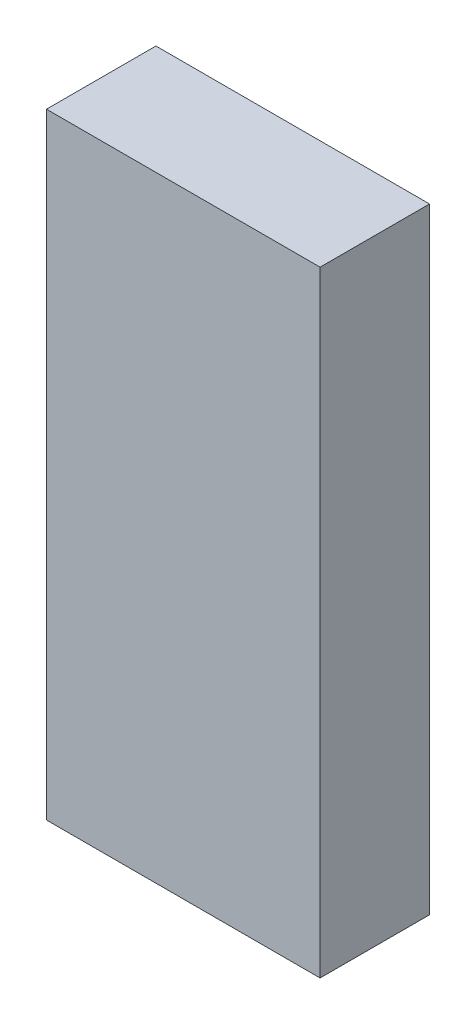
ISO-10303-21;
HEADER;
FILE_DESCRIPTION(('STEP AP214'),'2;1');
FILE_NAME('part.step','',(''),(''),'','','');
FILE_SCHEMA(('AUTOMOTIVE_DESIGN { 1 0 10303 214 1 1 1 1 }'));
ENDSEC;
DATA;
#1=APPLICATION_CONTEXT('core data for automotive mechanical design processes');
#2=APPLICATION_PROTOCOL_DEFINITION('international standard','automotive_design',2000,#1);
#3=PRODUCT_CONTEXT('',#1,'mechanical');
#4=PRODUCT('Part','Part','',(#3));
#5=PRODUCT_RELATED_PRODUCT_CATEGORY('part','',(#4));
#6=PRODUCT_DEFINITION_FORMATION('','',#4);
#7=PRODUCT_DEFINITION_CONTEXT('part definition',#1,'design');
#8=PRODUCT_DEFINITION('design','',#6,#7);
#9=PRODUCT_DEFINITION_SHAPE('','',#8);
#10=(LENGTH_UNIT() NAMED_UNIT(*) SI_UNIT(.MILLI.,.METRE.));
#11=(NAMED_UNIT(*) PLANE_ANGLE_UNIT() SI_UNIT($,.RADIAN.));
#12=(NAMED_UNIT(*) SI_UNIT($,.STERADIAN.) SOLID_ANGLE_UNIT());
#13=UNCERTAINTY_MEASURE_WITH_UNIT(LENGTH_MEASURE(1.E-05),#10,'distance_accuracy_value','');
#14=(GEOMETRIC_REPRESENTATION_CONTEXT(3) GLOBAL_UNCERTAINTY_ASSIGNED_CONTEXT((#13)) GLOBAL_UNIT_ASSIGNED_CONTEXT((#10,
#11,#12)) REPRESENTATION_CONTEXT('',''));
#15=CARTESIAN_POINT('',(0.,0.,0.));
#16=DIRECTION('',(0.,0.,1.));
#17=DIRECTION('',(1.,0.,0.));
#18=AXIS2_PLACEMENT_3D('',#15,#16,#17);
#19=CARTESIAN_POINT('',(0.,0.,8.));
#20=DIRECTION('',(1.,0.,0.));
#21=DIRECTION('',(0.,1.,0.));
#22=AXIS2_PLACEMENT_3D('',#19,#20,#21);
#23=PLANE('',#22);
#24=DIRECTION('',(0.,-1.,0.));
#25=VECTOR('',#24,1.);
#26=CARTESIAN_POINT('',(0.,0.,0.));
#27=LINE('',#26,#25);
#28=CARTESIAN_POINT('',(0.,45.,0.));
#29=VERTEX_POINT('',#28);
#30=CARTESIAN_POINT('',(0.,0.,0.));
#31=VERTEX_POINT('',#30);
#32=EDGE_CURVE('E94',#29,#31,#27,.T.);
#33=ORIENTED_EDGE('',*,*,#32,.T.);
#34=DIRECTION('',(0.,0.,-1.));
#35=VECTOR('',#34,1.);
#36=CARTESIAN_POINT('',(0.,0.,8.));
#37=LINE('',#36,#35);
#38=CARTESIAN_POINT('',(0.,0.,8.));
#39=VERTEX_POINT('',#38);
#40=EDGE_CURVE('E11',#39,#31,#37,.T.);
#41=ORIENTED_EDGE('',*,*,#40,.F.);
#42=DIRECTION('',(0.,-1.,0.));
#43=VECTOR('',#42,1.);
#44=CARTESIAN_POINT('',(0.,0.,8.));
#45=LINE('',#44,#43);
#46=CARTESIAN_POINT('',(0.,45.,8.));
#47=VERTEX_POINT('',#46);
#48=EDGE_CURVE('E82',#47,#39,#45,.T.);
#49=ORIENTED_EDGE('',*,*,#48,.F.);
#50=DIRECTION('',(0.,0.,-1.));
#51=VECTOR('',#50,1.);
#52=CARTESIAN_POINT('',(0.,45.,8.));
#53=LINE('',#52,#51);
#54=EDGE_CURVE('E90',#47,#29,#53,.T.);
#55=ORIENTED_EDGE('',*,*,#54,.T.);
#56=EDGE_LOOP('',(#33,#41,#49,#55));
#57=FACE_BOUND('',#56,.T.);
#58=ADVANCED_FACE('F31',(#57),#23,.F.);
#59=CARTESIAN_POINT('',(0.,0.,8.));
#60=DIRECTION('',(0.,1.,0.));
#61=DIRECTION('',(0.,0.,1.));
#62=AXIS2_PLACEMENT_3D('',#59,#60,#61);
#63=PLANE('',#62);
#64=DIRECTION('',(1.,0.,0.));
#65=VECTOR('',#64,1.);
#66=CARTESIAN_POINT('',(0.,0.,0.));
#67=LINE('',#66,#65);
#68=CARTESIAN_POINT('',(20.,0.,0.));
#69=VERTEX_POINT('',#68);
#70=EDGE_CURVE('E86',#31,#69,#67,.T.);
#71=ORIENTED_EDGE('',*,*,#70,.T.);
#72=DIRECTION('',(0.,0.,-1.));
#73=VECTOR('',#72,1.);
#74=CARTESIAN_POINT('',(20.,0.,8.));
#75=LINE('',#74,#73);
#76=CARTESIAN_POINT('',(20.,0.,8.));
#77=VERTEX_POINT('',#76);
#78=EDGE_CURVE('E39',#77,#69,#75,.T.);
#79=ORIENTED_EDGE('',*,*,#78,.F.);
#80=DIRECTION('',(1.,0.,0.));
#81=VECTOR('',#80,1.);
#82=CARTESIAN_POINT('',(0.,0.,8.));
#83=LINE('',#82,#81);
#84=EDGE_CURVE('E77',#39,#77,#83,.T.);
#85=ORIENTED_EDGE('',*,*,#84,.F.);
#86=ORIENTED_EDGE('',*,*,#40,.T.);
#87=EDGE_LOOP('',(#71,#79,#85,#86));
#88=FACE_BOUND('',#87,.T.);
#89=ADVANCED_FACE('F85',(#88),#63,.F.);
#90=CARTESIAN_POINT('',(20.,0.,8.));
#91=DIRECTION('',(-1.,0.,0.));
#92=DIRECTION('',(0.,-1.,0.));
#93=AXIS2_PLACEMENT_3D('',#90,#91,#92);
#94=PLANE('',#93);
#95=DIRECTION('',(0.,1.,0.));
#96=VECTOR('',#95,1.);
#97=CARTESIAN_POINT('',(20.,0.,0.));
#98=LINE('',#97,#96);
#99=CARTESIAN_POINT('',(20.,45.,0.));
#100=VERTEX_POINT('',#99);
#101=EDGE_CURVE('E64',#69,#100,#98,.T.);
#102=ORIENTED_EDGE('',*,*,#101,.T.);
#103=DIRECTION('',(0.,0.,-1.));
#104=VECTOR('',#103,1.);
#105=CARTESIAN_POINT('',(20.,45.,8.));
#106=LINE('',#105,#104);
#107=CARTESIAN_POINT('',(20.,45.,8.));
#108=VERTEX_POINT('',#107);
#109=EDGE_CURVE('E87',#108,#100,#106,.T.);
#110=ORIENTED_EDGE('',*,*,#109,.F.);
#111=DIRECTION('',(0.,1.,0.));
#112=VECTOR('',#111,1.);
#113=CARTESIAN_POINT('',(20.,0.,8.));
#114=LINE('',#113,#112);
#115=EDGE_CURVE('E80',#77,#108,#114,.T.);
#116=ORIENTED_EDGE('',*,*,#115,.F.);
#117=ORIENTED_EDGE('',*,*,#78,.T.);
#118=EDGE_LOOP('',(#102,#110,#116,#117));
#119=FACE_BOUND('',#118,.T.);
#120=ADVANCED_FACE('F88',(#119),#94,.F.);
#121=CARTESIAN_POINT('',(0.,45.,8.));
#122=DIRECTION('',(0.,-1.,0.));
#123=DIRECTION('',(0.,0.,-1.));
#124=AXIS2_PLACEMENT_3D('',#121,#122,#123);
#125=PLANE('',#124);
#126=DIRECTION('',(-1.,0.,0.));
#127=VECTOR('',#126,1.);
#128=CARTESIAN_POINT('',(0.,45.,0.));
#129=LINE('',#128,#127);
#130=EDGE_CURVE('E70',#100,#29,#129,.T.);
#131=ORIENTED_EDGE('',*,*,#130,.T.);
#132=ORIENTED_EDGE('',*,*,#54,.F.);
#133=DIRECTION('',(-1.,0.,0.));
#134=VECTOR('',#133,1.);
#135=CARTESIAN_POINT('',(0.,45.,8.));
#136=LINE('',#135,#134);
#137=EDGE_CURVE('E47',#108,#47,#136,.T.);
#138=ORIENTED_EDGE('',*,*,#137,.F.);
#139=ORIENTED_EDGE('',*,*,#109,.T.);
#140=EDGE_LOOP('',(#131,#132,#138,#139));
#141=FACE_BOUND('',#140,.T.);
#142=ADVANCED_FACE('F101',(#141),#125,.F.);
#143=CARTESIAN_POINT('',(0.,45.,8.));
#144=DIRECTION('',(0.,0.,-1.));
#145=DIRECTION('',(-1.,0.,0.));
#146=AXIS2_PLACEMENT_3D('',#143,#144,#145);
#147=PLANE('',#146);
#148=ORIENTED_EDGE('',*,*,#48,.T.);
#149=ORIENTED_EDGE('',*,*,#84,.T.);
#150=ORIENTED_EDGE('',*,*,#115,.T.);
#151=ORIENTED_EDGE('',*,*,#137,.T.);
#152=EDGE_LOOP('',(#148,#149,#150,#151));
#153=FACE_BOUND('',#152,.T.);
#154=ADVANCED_FACE('F78',(#153),#147,.F.);
#155=CARTESIAN_POINT('',(0.,45.,0.));
#156=DIRECTION('',(0.,0.,-1.));
#157=DIRECTION('',(-1.,0.,0.));
#158=AXIS2_PLACEMENT_3D('',#155,#156,#157);
#159=PLANE('',#158);
#160=ORIENTED_EDGE('',*,*,#32,.F.);
#161=ORIENTED_EDGE('',*,*,#130,.F.);
#162=ORIENTED_EDGE('',*,*,#101,.F.);
#163=ORIENTED_EDGE('',*,*,#70,.F.);
#164=EDGE_LOOP('',(#160,#161,#162,#163));
#165=FACE_BOUND('',#164,.T.);
#166=ADVANCED_FACE('F104',(#165),#159,.T.);
#167=CLOSED_SHELL('',(#58,#89,#120,#142,#154,#166));
#168=MANIFOLD_SOLID_BREP('B2',#167);
#169=ADVANCED_BREP_SHAPE_REPRESENTATION('',(#18,#168),#14);
#170=SHAPE_DEFINITION_REPRESENTATION(#9,#169);
ENDSEC;
END-ISO-10303-21;
